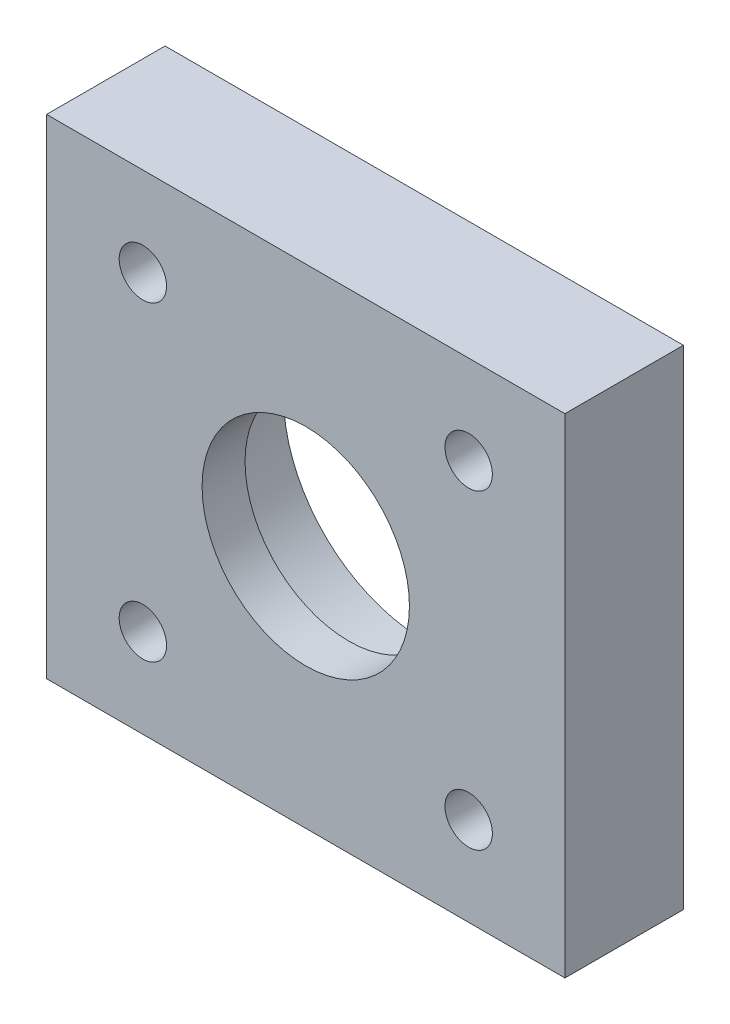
from build123d import *

# Parameters (mm, degrees)
SKETCH_1_W          = 57
SKETCH_1_H          = 55
EXTRUDE_1_DEPTH     = 8
SKETCH_5_R          = 7
SKETCH_5_R_2        = 1.6
CUT_EXTRUDE_1_DEPTH = 51.556119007
SKETCH_5_4_R        = 9.5
SKETCH_5_4_R_2      = 7
CUT_EXTRUDE_2_DEPTH = 5.1
SKETCH_7_W          = 57
SKETCH_7_H          = 55
SKETCH_7_W_2        = 35
SKETCH_7_H_2        = 33
CUT_EXTRUDE_4_DEPTH = 10


with BuildPart() as part:
    # Sketch 1 → Extrude 1 (new body)
    with BuildSketch(Plane.XY):
        with Locations((2.075531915, -11.959574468)):
            Rectangle(SKETCH_1_W, SKETCH_1_H)
    extrude(amount=EXTRUDE_1_DEPTH)

    # Sketch 5 → Cut-Extrude 1 (cut, through all)
    with BuildSketch(Plane(origin=(0, 0, 0), x_dir=(-1, 0, 0), z_dir=(0, 0, -1))):
        with Locations((-2.075531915, -11.959574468)):
            Circle(SKETCH_5_R)
        with Locations((-13.075531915, -1.459574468)):
            Circle(SKETCH_5_R_2)
        with Locations((8.924468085, -1.459574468)):
            Circle(SKETCH_5_R_2)
        with Locations((8.924468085, -22.459574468)):
            Circle(SKETCH_5_R_2)
        with Locations((-13.075531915, -22.459574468)):
            Circle(SKETCH_5_R_2)
    extrude(amount=-CUT_EXTRUDE_1_DEPTH, mode=Mode.SUBTRACT)

    # Sketch 5_4 → Cut-Extrude 2 (cut)
    with BuildSketch(Plane(origin=(0, 0, 0), x_dir=(-1, 0, 0), z_dir=(0, 0, -1))):
        with Locations((-2.075531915, -11.959574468)):
            Circle(SKETCH_5_4_R)
        with Locations((-2.075531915, -11.959574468)):
            Circle(SKETCH_5_4_R_2, mode=Mode.SUBTRACT)
    extrude(amount=-CUT_EXTRUDE_2_DEPTH, mode=Mode.SUBTRACT)

    # Sketch 7 → Cut-Extrude 4 (cut)
    with BuildSketch(Plane.XY.offset(8)):
        with Locations((2.075531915, -11.959574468)):
            Rectangle(SKETCH_7_W, SKETCH_7_H)
        with Locations((2.075531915, -11.959574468)):
            Rectangle(SKETCH_7_W_2, SKETCH_7_H_2, mode=Mode.SUBTRACT)
    extrude(amount=-CUT_EXTRUDE_4_DEPTH, mode=Mode.SUBTRACT)


solid = part.part
